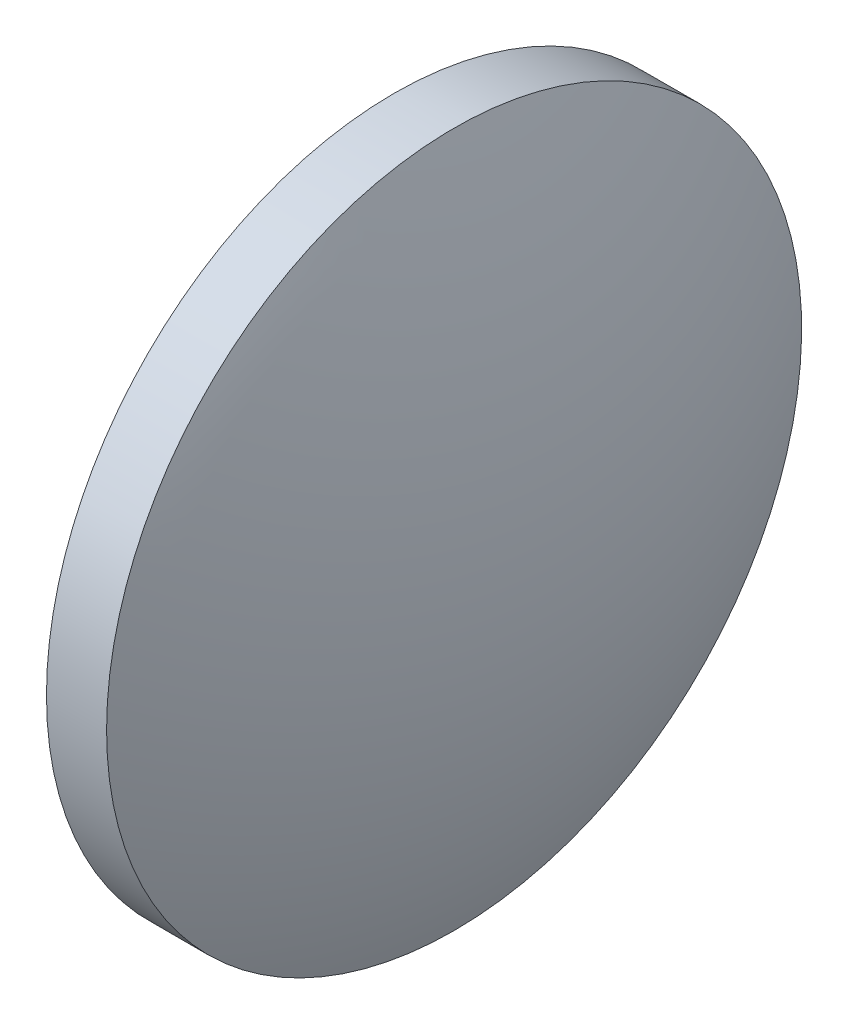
from build123d import *


with BuildPart() as part:
    # Sketch1 → Revolve1 (revolve)
    with BuildSketch(Plane.XY, mode=Mode.PRIVATE) as revolve1_sk:
        with BuildLine():
            Line((4.8, 0), (0, 0))
            ThreePointArc((0, 0), (0.326589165, -4.670452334), (1.3, -9.25))
            Line((1.3, -9.25), (2.9, -9.25))
            ThreePointArc((2.9, -9.25), (4.32009276, -4.721559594), (4.8, 0))
        make_face()
    revolve(revolve1_sk.sketch.rotate(Axis((-1.770551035, 0, 0), (1, 0, 0)), 270), axis=Axis((-1.770551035, 0, 0), (1, 0, 0)))


solid = part.part
